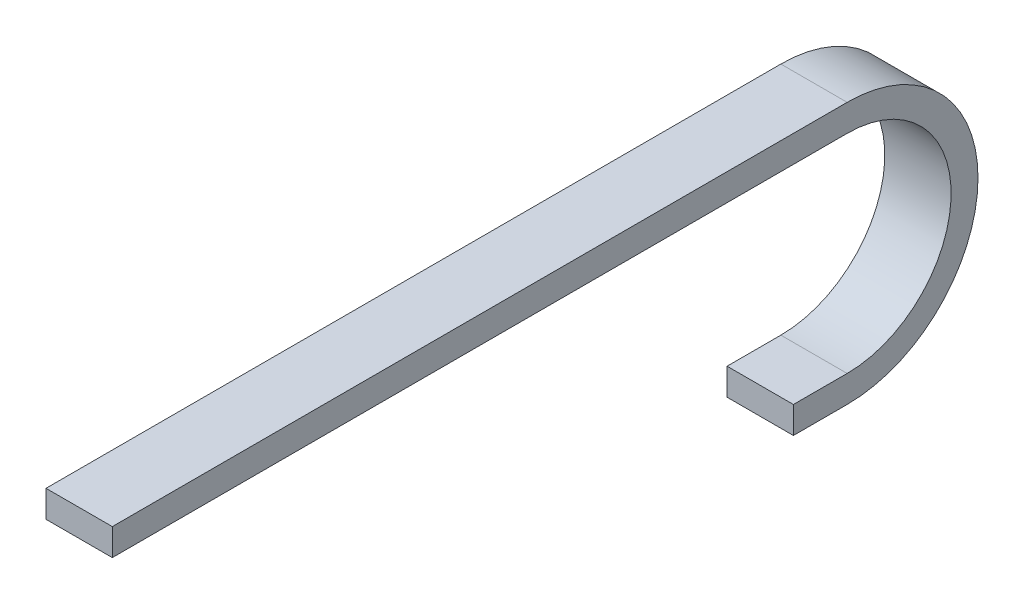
ISO-10303-21;
HEADER;
FILE_DESCRIPTION(('STEP AP214'),'2;1');
FILE_NAME('part.step','',(''),(''),'','','');
FILE_SCHEMA(('AUTOMOTIVE_DESIGN { 1 0 10303 214 1 1 1 1 }'));
ENDSEC;
DATA;
#1=APPLICATION_CONTEXT('core data for automotive mechanical design processes');
#2=APPLICATION_PROTOCOL_DEFINITION('international standard','automotive_design',2000,#1);
#3=PRODUCT_CONTEXT('',#1,'mechanical');
#4=PRODUCT('Part','Part','',(#3));
#5=PRODUCT_RELATED_PRODUCT_CATEGORY('part','',(#4));
#6=PRODUCT_DEFINITION_FORMATION('','',#4);
#7=PRODUCT_DEFINITION_CONTEXT('part definition',#1,'design');
#8=PRODUCT_DEFINITION('design','',#6,#7);
#9=PRODUCT_DEFINITION_SHAPE('','',#8);
#10=(LENGTH_UNIT() NAMED_UNIT(*) SI_UNIT(.MILLI.,.METRE.));
#11=(NAMED_UNIT(*) PLANE_ANGLE_UNIT() SI_UNIT($,.RADIAN.));
#12=(NAMED_UNIT(*) SI_UNIT($,.STERADIAN.) SOLID_ANGLE_UNIT());
#13=UNCERTAINTY_MEASURE_WITH_UNIT(LENGTH_MEASURE(1.E-05),#10,'distance_accuracy_value','');
#14=(GEOMETRIC_REPRESENTATION_CONTEXT(3) GLOBAL_UNCERTAINTY_ASSIGNED_CONTEXT((#13)) GLOBAL_UNIT_ASSIGNED_CONTEXT((#10,
#11,#12)) REPRESENTATION_CONTEXT('',''));
#15=CARTESIAN_POINT('',(0.,0.,0.));
#16=DIRECTION('',(0.,0.,1.));
#17=DIRECTION('',(1.,0.,0.));
#18=AXIS2_PLACEMENT_3D('',#15,#16,#17);
#19=CARTESIAN_POINT('',(-18.5,-138.5,-410.));
#20=DIRECTION('',(0.,1.,0.));
#21=DIRECTION('',(0.,0.,1.));
#22=AXIS2_PLACEMENT_3D('',#19,#20,#21);
#23=PLANE('',#22);
#24=DIRECTION('',(-1.,0.,0.));
#25=VECTOR('',#24,1.);
#26=CARTESIAN_POINT('',(-18.5,-138.5,-410.));
#27=LINE('',#26,#25);
#28=CARTESIAN_POINT('',(18.5,-138.5,-410.));
#29=VERTEX_POINT('',#28);
#30=CARTESIAN_POINT('',(-18.5,-138.5,-410.));
#31=VERTEX_POINT('',#30);
#32=EDGE_CURVE('E159',#29,#31,#27,.T.);
#33=ORIENTED_EDGE('',*,*,#32,.F.);
#34=DIRECTION('',(0.,0.,1.));
#35=VECTOR('',#34,1.);
#36=CARTESIAN_POINT('',(18.5,-138.5,-410.));
#37=LINE('',#36,#35);
#38=CARTESIAN_POINT('',(18.5,-138.5,-380.));
#39=VERTEX_POINT('',#38);
#40=EDGE_CURVE('E46',#29,#39,#37,.T.);
#41=ORIENTED_EDGE('',*,*,#40,.T.);
#42=DIRECTION('',(-1.,0.,0.));
#43=VECTOR('',#42,1.);
#44=CARTESIAN_POINT('',(-18.5,-138.5,-380.));
#45=LINE('',#44,#43);
#46=CARTESIAN_POINT('',(-18.5,-138.5,-380.));
#47=VERTEX_POINT('',#46);
#48=EDGE_CURVE('E53',#39,#47,#45,.T.);
#49=ORIENTED_EDGE('',*,*,#48,.T.);
#50=DIRECTION('',(0.,0.,1.));
#51=VECTOR('',#50,1.);
#52=CARTESIAN_POINT('',(-18.5,-138.5,-410.));
#53=LINE('',#52,#51);
#54=EDGE_CURVE('E11',#31,#47,#53,.T.);
#55=ORIENTED_EDGE('',*,*,#54,.F.);
#56=EDGE_LOOP('',(#33,#41,#49,#55));
#57=FACE_BOUND('',#56,.T.);
#58=ADVANCED_FACE('F38',(#57),#23,.F.);
#59=CARTESIAN_POINT('',(-18.5,-123.5,-410.));
#60=DIRECTION('',(0.,-1.,0.));
#61=DIRECTION('',(0.,0.,-1.));
#62=AXIS2_PLACEMENT_3D('',#59,#60,#61);
#63=PLANE('',#62);
#64=DIRECTION('',(1.,0.,0.));
#65=VECTOR('',#64,1.);
#66=CARTESIAN_POINT('',(-18.5,-123.5,-410.));
#67=LINE('',#66,#65);
#68=CARTESIAN_POINT('',(-18.5,-123.5,-410.));
#69=VERTEX_POINT('',#68);
#70=CARTESIAN_POINT('',(18.5,-123.5,-410.));
#71=VERTEX_POINT('',#70);
#72=EDGE_CURVE('E150',#69,#71,#67,.T.);
#73=ORIENTED_EDGE('',*,*,#72,.F.);
#74=DIRECTION('',(0.,0.,1.));
#75=VECTOR('',#74,1.);
#76=CARTESIAN_POINT('',(-18.5,-123.5,-410.));
#77=LINE('',#76,#75);
#78=CARTESIAN_POINT('',(-18.5,-123.5,-380.));
#79=VERTEX_POINT('',#78);
#80=EDGE_CURVE('E186',#69,#79,#77,.T.);
#81=ORIENTED_EDGE('',*,*,#80,.T.);
#82=DIRECTION('',(1.,0.,0.));
#83=VECTOR('',#82,1.);
#84=CARTESIAN_POINT('',(-18.5,-123.5,-380.));
#85=LINE('',#84,#83);
#86=CARTESIAN_POINT('',(18.5,-123.5,-380.));
#87=VERTEX_POINT('',#86);
#88=EDGE_CURVE('E180',#79,#87,#85,.T.);
#89=ORIENTED_EDGE('',*,*,#88,.T.);
#90=DIRECTION('',(0.,0.,1.));
#91=VECTOR('',#90,1.);
#92=CARTESIAN_POINT('',(18.5,-123.5,-410.));
#93=LINE('',#92,#91);
#94=EDGE_CURVE('E190',#71,#87,#93,.T.);
#95=ORIENTED_EDGE('',*,*,#94,.F.);
#96=EDGE_LOOP('',(#73,#81,#89,#95));
#97=FACE_BOUND('',#96,.T.);
#98=ADVANCED_FACE('F206',(#97),#63,.F.);
#99=CARTESIAN_POINT('',(0.,-65.5,-410.));
#100=DIRECTION('',(-1.,0.,0.));
#101=DIRECTION('',(0.,0.,1.));
#102=AXIS2_PLACEMENT_3D('',#99,#100,#101);
#103=CYLINDRICAL_SURFACE('',#102,73.);
#104=DIRECTION('',(-1.,0.,0.));
#105=VECTOR('',#104,1.);
#106=CARTESIAN_POINT('',(-18.5,7.49999999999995,-410.000000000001));
#107=LINE('',#106,#105);
#108=CARTESIAN_POINT('',(18.5,7.49999999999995,-410.000000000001));
#109=VERTEX_POINT('',#108);
#110=CARTESIAN_POINT('',(-18.5,7.49999999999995,-410.000000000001));
#111=VERTEX_POINT('',#110);
#112=EDGE_CURVE('E118',#109,#111,#107,.T.);
#113=ORIENTED_EDGE('',*,*,#112,.F.);
#114=CARTESIAN_POINT('',(18.5,-65.5,-410.));
#115=DIRECTION('',(-1.,0.,0.));
#116=DIRECTION('',(0.,0.,1.));
#117=AXIS2_PLACEMENT_3D('',#114,#115,#116);
#118=CIRCLE('',#117,73.);
#119=EDGE_CURVE('E169',#109,#29,#118,.T.);
#120=ORIENTED_EDGE('',*,*,#119,.T.);
#121=ORIENTED_EDGE('',*,*,#32,.T.);
#122=CARTESIAN_POINT('',(-18.5,-65.5,-410.));
#123=DIRECTION('',(-1.,0.,0.));
#124=DIRECTION('',(0.,0.,1.));
#125=AXIS2_PLACEMENT_3D('',#122,#123,#124);
#126=CIRCLE('',#125,73.);
#127=EDGE_CURVE('E173',#111,#31,#126,.T.);
#128=ORIENTED_EDGE('',*,*,#127,.F.);
#129=EDGE_LOOP('',(#113,#120,#121,#128));
#130=FACE_BOUND('',#129,.T.);
#131=ADVANCED_FACE('F198',(#130),#103,.T.);
#132=CARTESIAN_POINT('',(0.,-65.5,-410.));
#133=DIRECTION('',(-1.,0.,0.));
#134=DIRECTION('',(0.,0.,1.));
#135=AXIS2_PLACEMENT_3D('',#132,#133,#134);
#136=CYLINDRICAL_SURFACE('',#135,58.);
#137=DIRECTION('',(1.,0.,0.));
#138=VECTOR('',#137,1.);
#139=CARTESIAN_POINT('',(-18.5,-7.50000000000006,-410.));
#140=LINE('',#139,#138);
#141=CARTESIAN_POINT('',(-18.5,-7.50000000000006,-410.));
#142=VERTEX_POINT('',#141);
#143=CARTESIAN_POINT('',(18.5,-7.49999999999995,-410.));
#144=VERTEX_POINT('',#143);
#145=EDGE_CURVE('E141',#142,#144,#140,.T.);
#146=ORIENTED_EDGE('',*,*,#145,.F.);
#147=CARTESIAN_POINT('',(-18.5,-65.5,-410.));
#148=DIRECTION('',(-1.,0.,0.));
#149=DIRECTION('',(0.,0.,1.));
#150=AXIS2_PLACEMENT_3D('',#147,#148,#149);
#151=CIRCLE('',#150,58.);
#152=EDGE_CURVE('E112',#142,#69,#151,.T.);
#153=ORIENTED_EDGE('',*,*,#152,.T.);
#154=ORIENTED_EDGE('',*,*,#72,.T.);
#155=CARTESIAN_POINT('',(18.5,-65.5,-410.));
#156=DIRECTION('',(-1.,0.,0.));
#157=DIRECTION('',(0.,0.,1.));
#158=AXIS2_PLACEMENT_3D('',#155,#156,#157);
#159=CIRCLE('',#158,58.);
#160=EDGE_CURVE('E165',#144,#71,#159,.T.);
#161=ORIENTED_EDGE('',*,*,#160,.F.);
#162=EDGE_LOOP('',(#146,#153,#154,#161));
#163=FACE_BOUND('',#162,.T.);
#164=ADVANCED_FACE('F208',(#163),#136,.F.);
#165=CARTESIAN_POINT('',(-18.5,7.49999999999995,-410.000000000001));
#166=DIRECTION('',(-1.,0.,0.));
#167=DIRECTION('',(0.,-1.,0.));
#168=AXIS2_PLACEMENT_3D('',#165,#166,#167);
#169=PLANE('',#168);
#170=DIRECTION('',(0.,-1.,0.));
#171=VECTOR('',#170,1.);
#172=CARTESIAN_POINT('',(-18.5,7.49999999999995,2.35922392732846E-13));
#173=LINE('',#172,#171);
#174=CARTESIAN_POINT('',(-18.5,7.49999999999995,2.35922392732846E-13));
#175=VERTEX_POINT('',#174);
#176=CARTESIAN_POINT('',(-18.5,-7.49999999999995,2.35922392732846E-13));
#177=VERTEX_POINT('',#176);
#178=EDGE_CURVE('E109',#175,#177,#173,.T.);
#179=ORIENTED_EDGE('',*,*,#178,.F.);
#180=DIRECTION('',(0.,0.,1.));
#181=VECTOR('',#180,1.);
#182=CARTESIAN_POINT('',(-18.5,7.49999999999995,-410.000000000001));
#183=LINE('',#182,#181);
#184=EDGE_CURVE('E147',#111,#175,#183,.T.);
#185=ORIENTED_EDGE('',*,*,#184,.F.);
#186=ORIENTED_EDGE('',*,*,#127,.T.);
#187=ORIENTED_EDGE('',*,*,#54,.T.);
#188=DIRECTION('',(0.,1.,0.));
#189=VECTOR('',#188,1.);
#190=CARTESIAN_POINT('',(-18.5,-138.5,-380.));
#191=LINE('',#190,#189);
#192=EDGE_CURVE('E177',#47,#79,#191,.T.);
#193=ORIENTED_EDGE('',*,*,#192,.T.);
#194=ORIENTED_EDGE('',*,*,#80,.F.);
#195=ORIENTED_EDGE('',*,*,#152,.F.);
#196=DIRECTION('',(0.,0.,1.));
#197=VECTOR('',#196,1.);
#198=CARTESIAN_POINT('',(-18.5,-7.50000000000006,-410.));
#199=LINE('',#198,#197);
#200=EDGE_CURVE('E104',#142,#177,#199,.T.);
#201=ORIENTED_EDGE('',*,*,#200,.T.);
#202=EDGE_LOOP('',(#179,#185,#186,#187,#193,#194,#195,#201));
#203=FACE_BOUND('',#202,.T.);
#204=ADVANCED_FACE('F106',(#203),#169,.T.);
#205=CARTESIAN_POINT('',(-18.5,7.49999999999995,-410.000000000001));
#206=DIRECTION('',(0.,1.,0.));
#207=DIRECTION('',(0.,0.,1.));
#208=AXIS2_PLACEMENT_3D('',#205,#206,#207);
#209=PLANE('',#208);
#210=DIRECTION('',(-1.,0.,0.));
#211=VECTOR('',#210,1.);
#212=CARTESIAN_POINT('',(-18.5,7.49999999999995,2.35922392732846E-13));
#213=LINE('',#212,#211);
#214=CARTESIAN_POINT('',(18.5,7.49999999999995,0.));
#215=VERTEX_POINT('',#214);
#216=EDGE_CURVE('E132',#215,#175,#213,.T.);
#217=ORIENTED_EDGE('',*,*,#216,.F.);
#218=DIRECTION('',(0.,0.,1.));
#219=VECTOR('',#218,1.);
#220=CARTESIAN_POINT('',(18.5,7.49999999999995,-410.000000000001));
#221=LINE('',#220,#219);
#222=EDGE_CURVE('E151',#109,#215,#221,.T.);
#223=ORIENTED_EDGE('',*,*,#222,.F.);
#224=ORIENTED_EDGE('',*,*,#112,.T.);
#225=ORIENTED_EDGE('',*,*,#184,.T.);
#226=EDGE_LOOP('',(#217,#223,#224,#225));
#227=FACE_BOUND('',#226,.T.);
#228=ADVANCED_FACE('F200',(#227),#209,.T.);
#229=CARTESIAN_POINT('',(18.5,7.49999999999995,-410.000000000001));
#230=DIRECTION('',(1.,0.,0.));
#231=DIRECTION('',(0.,1.,0.));
#232=AXIS2_PLACEMENT_3D('',#229,#230,#231);
#233=PLANE('',#232);
#234=DIRECTION('',(0.,1.,0.));
#235=VECTOR('',#234,1.);
#236=CARTESIAN_POINT('',(18.5,7.49999999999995,0.));
#237=LINE('',#236,#235);
#238=CARTESIAN_POINT('',(18.5,-7.49999999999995,0.));
#239=VERTEX_POINT('',#238);
#240=EDGE_CURVE('E128',#239,#215,#237,.T.);
#241=ORIENTED_EDGE('',*,*,#240,.F.);
#242=DIRECTION('',(0.,0.,1.));
#243=VECTOR('',#242,1.);
#244=CARTESIAN_POINT('',(18.5,-7.49999999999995,-410.));
#245=LINE('',#244,#243);
#246=EDGE_CURVE('E117',#144,#239,#245,.T.);
#247=ORIENTED_EDGE('',*,*,#246,.F.);
#248=ORIENTED_EDGE('',*,*,#160,.T.);
#249=ORIENTED_EDGE('',*,*,#94,.T.);
#250=DIRECTION('',(0.,-1.,0.));
#251=VECTOR('',#250,1.);
#252=CARTESIAN_POINT('',(18.5,-138.5,-380.));
#253=LINE('',#252,#251);
#254=EDGE_CURVE('E61',#87,#39,#253,.T.);
#255=ORIENTED_EDGE('',*,*,#254,.T.);
#256=ORIENTED_EDGE('',*,*,#40,.F.);
#257=ORIENTED_EDGE('',*,*,#119,.F.);
#258=ORIENTED_EDGE('',*,*,#222,.T.);
#259=EDGE_LOOP('',(#241,#247,#248,#249,#255,#256,#257,#258));
#260=FACE_BOUND('',#259,.T.);
#261=ADVANCED_FACE('F194',(#260),#233,.T.);
#262=CARTESIAN_POINT('',(-18.5,-7.50000000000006,-410.));
#263=DIRECTION('',(0.,-1.,0.));
#264=DIRECTION('',(1.,0.,0.));
#265=AXIS2_PLACEMENT_3D('',#262,#263,#264);
#266=PLANE('',#265);
#267=DIRECTION('',(1.,0.,0.));
#268=VECTOR('',#267,1.);
#269=CARTESIAN_POINT('',(-18.5,-7.49999999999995,2.35922392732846E-13));
#270=LINE('',#269,#268);
#271=EDGE_CURVE('E121',#177,#239,#270,.T.);
#272=ORIENTED_EDGE('',*,*,#271,.F.);
#273=ORIENTED_EDGE('',*,*,#200,.F.);
#274=ORIENTED_EDGE('',*,*,#145,.T.);
#275=ORIENTED_EDGE('',*,*,#246,.T.);
#276=EDGE_LOOP('',(#272,#273,#274,#275));
#277=FACE_BOUND('',#276,.T.);
#278=ADVANCED_FACE('F122',(#277),#266,.T.);
#279=CARTESIAN_POINT('',(-18.5,-123.5,-380.));
#280=DIRECTION('',(0.,0.,-1.));
#281=DIRECTION('',(1.,0.,0.));
#282=AXIS2_PLACEMENT_3D('',#279,#280,#281);
#283=PLANE('',#282);
#284=ORIENTED_EDGE('',*,*,#192,.F.);
#285=ORIENTED_EDGE('',*,*,#48,.F.);
#286=ORIENTED_EDGE('',*,*,#254,.F.);
#287=ORIENTED_EDGE('',*,*,#88,.F.);
#288=EDGE_LOOP('',(#284,#285,#286,#287));
#289=FACE_BOUND('',#288,.T.);
#290=ADVANCED_FACE('F204',(#289),#283,.F.);
#291=CARTESIAN_POINT('',(-18.5,-7.49999999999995,2.35922392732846E-13));
#292=DIRECTION('',(0.,0.,1.));
#293=DIRECTION('',(1.,0.,0.));
#294=AXIS2_PLACEMENT_3D('',#291,#292,#293);
#295=PLANE('',#294);
#296=ORIENTED_EDGE('',*,*,#178,.T.);
#297=ORIENTED_EDGE('',*,*,#271,.T.);
#298=ORIENTED_EDGE('',*,*,#240,.T.);
#299=ORIENTED_EDGE('',*,*,#216,.T.);
#300=EDGE_LOOP('',(#296,#297,#298,#299));
#301=FACE_BOUND('',#300,.T.);
#302=ADVANCED_FACE('F130',(#301),#295,.T.);
#303=CLOSED_SHELL('',(#58,#98,#131,#164,#204,#228,#261,#278,#290,#302));
#304=MANIFOLD_SOLID_BREP('B2',#303);
#305=ADVANCED_BREP_SHAPE_REPRESENTATION('',(#18,#304),#14);
#306=SHAPE_DEFINITION_REPRESENTATION(#9,#305);
ENDSEC;
END-ISO-10303-21;
